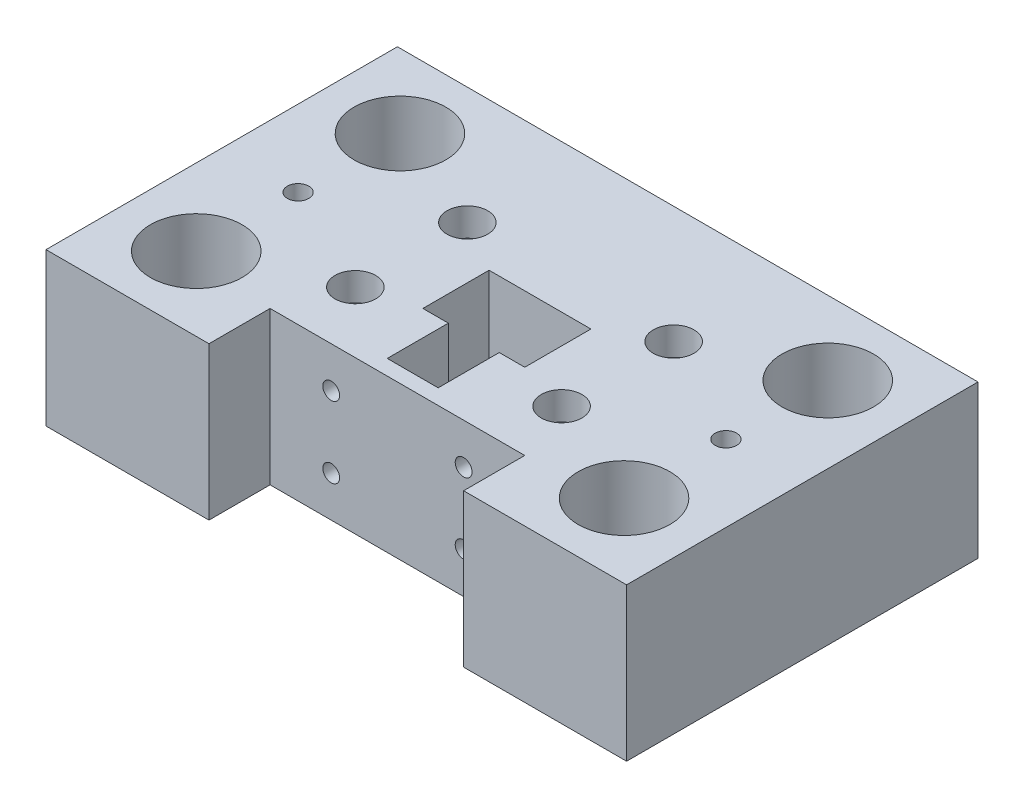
from build123d import *

# Parameters (mm, degrees)
SKETCH_1_W           = 114
SKETCH_1_H           = 30
EXTRUDE_1_DEPTH      = 69
SKETCH_2_OUTSIDE_W   = 143.318
SKETCH_2_OUTSIDE_H   = 98.318
SKETCH_2_OUTSIDE_R   = 9
SKETCH_2_OUTSIDE_R_2 = 2.5
CUT_EXTRUDE_1_DEPTH  = 69
SKETCH_3_W           = 10
SKETCH_3_H           = 2
CUT_EXTRUDE_2_DEPTH  = 25
SKETCH_4_R           = 4
CUT_EXTRUDE_3_DEPTH  = 5.5
SKETCH_5_R           = 2.1
CUT_EXTRUDE_4_DEPTH  = 15
SKETCH_7_R           = 1.65
CUT_EXTRUDE_5_DEPTH  = 15
SKETCH_8_R           = 1.65
CUT_EXTRUDE_6_DEPTH  = 15


with BuildPart() as part:
    # Sketch 1 → Extrude 1 (new body)
    with BuildSketch(Plane.XY):
        with Locations((57, 15)):
            Rectangle(SKETCH_1_W, SKETCH_1_H)
    extrude(amount=EXTRUDE_1_DEPTH)

    # Sketch 2 outside → Cut-Extrude 1 (cut)
    # profile 1 of 10: a face of its own
    with BuildSketch(Plane(origin=(0, 30, 0), x_dir=(1, 0, 0), z_dir=(0, 1, 0))):
        with Locations((57, -34.5)):
            Rectangle(SKETCH_2_OUTSIDE_W, SKETCH_2_OUTSIDE_H)
        Polygon((0, -69), (32, -69), (32, -57), (82, -57), (82, -69), (114, -69), (114, 0), (0, 0), align=None, mode=Mode.SUBTRACT)
    # profile 2 of 10: a face of its own
    with BuildSketch(Plane(origin=(0, 30, 0), x_dir=(1, 0, 0), z_dir=(0, 1, 0))):
        with Locations(Location((15, -14.5, 0), (0, 0, 270))):
            Circle(SKETCH_2_OUTSIDE_R)
    # profile 3 of 10: a face of its own
    with BuildSketch(Plane(origin=(0, 30, 0), x_dir=(1, 0, 0), z_dir=(0, 1, 0))):
        with Locations(Location((99, -14.5, 0), (0, 0, 270))):
            Circle(SKETCH_2_OUTSIDE_R)
    # profile 4 of 10: a face of its own
    with BuildSketch(Plane(origin=(0, 30, 0), x_dir=(1, 0, 0), z_dir=(0, 1, 0))):
        with Locations(Location((99, -54.5, 0), (0, 0, 270))):
            Circle(SKETCH_2_OUTSIDE_R)
    # profile 5 of 10: a face of its own
    with BuildSketch(Plane(origin=(0, 30, 0), x_dir=(1, 0, 0), z_dir=(0, 1, 0))):
        with Locations(Location((15, -54.5, 0), (0, 0, 270))):
            Circle(SKETCH_2_OUTSIDE_R)
    # profile 6 of 10: a face of its own
    with BuildSketch(Plane(origin=(0, 30, 0), x_dir=(1, 0, 0), z_dir=(0, 1, 0))):
        with Locations(Location((36.75, -45.012040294, 0), (0, 0, 270))):
            Circle(SKETCH_2_OUTSIDE_R_2)
    # profile 7 of 10: a face of its own
    with BuildSketch(Plane(origin=(0, 30, 0), x_dir=(1, 0, 0), z_dir=(0, 1, 0))):
        with Locations(Location((77.25, -45.012040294, 0), (0, 0, 270))):
            Circle(SKETCH_2_OUTSIDE_R_2)
    # profile 8 of 10: a face of its own
    with BuildSketch(Plane(origin=(0, 30, 0), x_dir=(1, 0, 0), z_dir=(0, 1, 0))):
        with Locations(Location((77.25, -23.012040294, 0), (0, 0, 270))):
            Circle(SKETCH_2_OUTSIDE_R_2)
    # profile 9 of 10: a face of its own
    with BuildSketch(Plane(origin=(0, 30, 0), x_dir=(1, 0, 0), z_dir=(0, 1, 0))):
        with Locations(Location((36.75, -23.012040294, 0), (0, 0, 270))):
            Circle(SKETCH_2_OUTSIDE_R_2)
    # profile 10 of 10: a face of its own
    with BuildSketch(Plane(origin=(0, 30, 0), x_dir=(1, 0, 0), z_dir=(0, 1, 0))):
        Polygon((47, -42), (52, -42), (52, -52), (62, -52), (62, -42), (67, -42), (67, -29), (47, -29), align=None)
    extrude(amount=-CUT_EXTRUDE_1_DEPTH, mode=Mode.SUBTRACT)

    # Sketch 3 → Cut-Extrude 2 (cut)
    with BuildSketch(Plane(origin=(0, 30, 0), x_dir=(1, 0, 0), z_dir=(0, 1, 0))):
        with Locations((57, -53)):
            Rectangle(SKETCH_3_W, SKETCH_3_H)
    extrude(amount=-CUT_EXTRUDE_2_DEPTH, mode=Mode.SUBTRACT)

    # Sketch 4 → Cut-Extrude 3 (cut)
    with BuildSketch(Plane(origin=(0, 30, 0), x_dir=(1, 0, 0), z_dir=(0, 1, 0))):
        with Locations(Location((36.75, -45.012040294, 0), (0, 0, 270))):
            Circle(SKETCH_4_R)
        with Locations(Location((77.25, -45.012040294, 0), (0, 0, 270))):
            Circle(SKETCH_4_R)
        with Locations(Location((77.25, -23.012040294, 0), (0, 0, 270))):
            Circle(SKETCH_4_R)
        with Locations(Location((36.75, -23.012040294, 0), (0, 0, 270))):
            Circle(SKETCH_4_R)
    extrude(amount=-CUT_EXTRUDE_3_DEPTH, mode=Mode.SUBTRACT)

    # Sketch 5 → Cut-Extrude 4 (cut)
    with BuildSketch(Plane(origin=(0, 30, 0), x_dir=(1, 0, 0), z_dir=(0, 1, 0))):
        with Locations(Location((15, -34.5, 0), (0, 0, 270))):
            Circle(SKETCH_5_R)
        with Locations(Location((99, -34.5, 0), (0, 0, 270))):
            Circle(SKETCH_5_R)
    extrude(amount=-CUT_EXTRUDE_4_DEPTH, mode=Mode.SUBTRACT)

    # Sketch 7 → Cut-Extrude 5 (cut)
    with BuildSketch(Plane.XZ):
        with Locations(Location((42, 35.5, 0), (0, 0, 270))):
            Circle(SKETCH_7_R)
        with Locations(Location((72, 35.5, 0), (0, 0, 270))):
            Circle(SKETCH_7_R)
    extrude(amount=-CUT_EXTRUDE_5_DEPTH, mode=Mode.SUBTRACT)

    # Sketch 8 → Cut-Extrude 6 (cut)
    with BuildSketch(Plane.XY.offset(57)):
        with Locations((44, 22)):
            Circle(SKETCH_8_R)
        with Locations((70, 22)):
            Circle(SKETCH_8_R)
        with Locations((70, 8)):
            Circle(SKETCH_8_R)
        with Locations((44, 8)):
            Circle(SKETCH_8_R)
    extrude(amount=-CUT_EXTRUDE_6_DEPTH, mode=Mode.SUBTRACT)


solid = part.part
